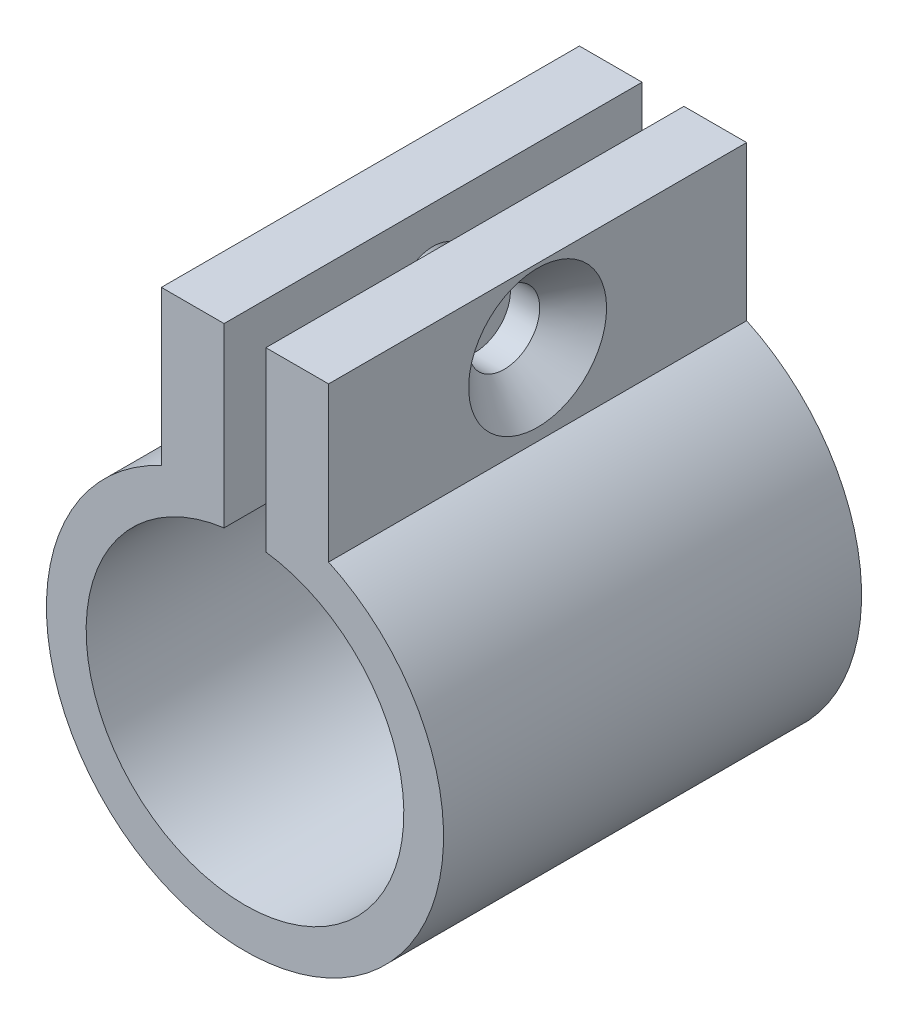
from build123d import *

# Parameters (mm, degrees)
SKETCH_1_R                   = 9.5
SKETCH_1_R_2                 = 7.6
EXTRUDE_1_DEPTH              = 20
EXTRUDE_START                = -20
EXTRUDE_3_DEPTH              = 20
CUT_EXTRUDE_START            = -20
CUT_EXTRUDE_3_DEPTH          = 20
HOLE_WIZARD_M3_1_D           = 3.4
HOLE_WIZARD_M3_1_CSINK_D     = 6.6
HOLE_WIZARD_M3_1_CSINK_ANGLE = 90
SKETCH_13_W                  = 21.777861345
SKETCH_13_H                  = 29.188097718
CUT_EXTRUDE_4_DEPTH          = 2


with BuildPart() as part:
    # Sketch 1 → Extrude 1 (new body)
    with BuildSketch(Plane.XY):
        Circle(SKETCH_1_R)
        Circle(SKETCH_1_R_2, mode=Mode.SUBTRACT)
    extrude(amount=EXTRUDE_1_DEPTH)

    # Sketch 4 → Extrude 3 (add)
    with BuildSketch(Plane.XY.offset(20).offset(EXTRUDE_START)):
        with BuildLine():
            Line((-4, 6.462197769), (-4, 18))
            Line((-4, 18), (4, 18))
            Line((4, 18), (4, 6.462197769))
            ThreePointArc((4, 6.462197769), (0, 7.6), (-4, 6.462197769))
        make_face()
    extrude(amount=EXTRUDE_3_DEPTH)

    # Sketch 10 → Cut-Extrude 3 (cut)
    with BuildSketch(Plane.XY.offset(20).offset(CUT_EXTRUDE_START)):
        with BuildLine():
            Line((-1, 7.533923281), (-1, 25))
            Line((-1, 25), (1, 25))
            Line((1, 25), (1, 7.533923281))
            ThreePointArc((1, 7.533923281), (0, 7.6), (-1, 7.533923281))
        make_face()
    extrude(amount=CUT_EXTRUDE_3_DEPTH, mode=Mode.SUBTRACT)

    # Hole Wizard M3 _1 (through all)
    with Locations(Plane(origin=(4, 0, 0), x_dir=(0, 0, -1), z_dir=(1, 0, 0))):
        with Locations((-10, 12.5)):
            CounterSinkHole(HOLE_WIZARD_M3_1_D / 2, HOLE_WIZARD_M3_1_CSINK_D / 2, counter_sink_angle=HOLE_WIZARD_M3_1_CSINK_ANGLE)

    # Sketch 13 → Cut-Extrude 4 (cut)
    with BuildSketch(Plane(origin=(0, 18, 0), x_dir=(1, 0, 0), z_dir=(0, 1, 0))):
        with Locations((2.202486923, -9.816971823)):
            Rectangle(SKETCH_13_W, SKETCH_13_H)
    extrude(amount=-CUT_EXTRUDE_4_DEPTH, mode=Mode.SUBTRACT)


solid = part.part
